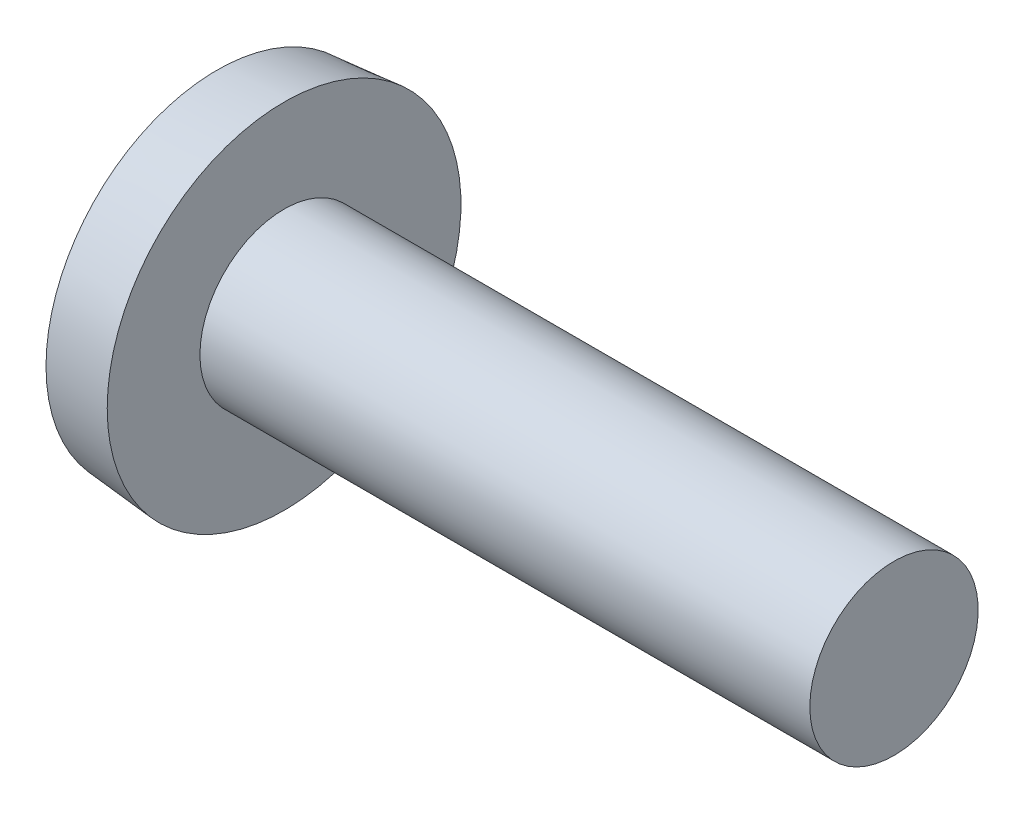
from build123d import *

# Parameters (mm, degrees)
CIRPATTERN1_COUNT = 2
CIRPATTERN1_ANGLE = 90


with BuildPart() as part:
    # BodySke → Base-Revolve (revolve)
    with BuildSketch(Plane.XY, mode=Mode.PRIVATE) as base_revolve_sk:
        with BuildLine():
            Line((2.2098, 1.7526), (2.2098, 3.683))
            Line((2.2098, 3.683), (0.8128, 3.560778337))
            ThreePointArc((0.8128, 3.560778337), (0.205780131, 1.826183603), (0, 0))
            Line((0, 0), (14.9098, 0))
            Line((14.9098, 0), (14.9098, 1.7526))
            Line((14.9098, 1.7526), (2.2098, 1.7526))
        make_face()
    revolve(base_revolve_sk.sketch.rotate(Axis((-25.4, 0, 0), (1, 0, 0)), 90), axis=Axis((-25.4, 0, 0), (1, 0, 0)))

    # Sketch3 → Cross section 0
    with BuildSketch(Plane(origin=(0, 0, 0), x_dir=(0, 0, -1), z_dir=(1, 0, 0))):
        with BuildLine():
            Line((-0.4953, 2.413), (0.4953, 2.413))
            Line((0.4953, 2.413), (0.4953, -2.413))
            Line((0.4953, -2.413), (-0.4953, -2.413))
            Line((-0.4953, -2.413), (-0.4953, 2.413))
        make_face()
    # Sketch4 → Cross section 1
    with BuildSketch(Plane(origin=(2.794, 0, 0), x_dir=(0, 0, -1), z_dir=(1, 0, 0))):
        with BuildLine():
            Line((-0.24765, 0.24765), (0.24765, 0.24765))
            Line((0.24765, 0.24765), (0.24765, -0.24765))
            Line((0.24765, -0.24765), (-0.24765, -0.24765))
            Line((-0.24765, -0.24765), (-0.24765, 0.24765))
        make_face()
    cross = loft(mode=Mode.SUBTRACT)

    # CirPattern1: Cross ×2 about axis
    cirpattern1_axis = Axis((0, 0, 0), (1, 0, 0))
    for i in range(1, CIRPATTERN1_COUNT):
        add(cross.rotate(cirpattern1_axis, i * CIRPATTERN1_ANGLE / (CIRPATTERN1_COUNT - 1)), mode=Mode.SUBTRACT)


solid = part.part
